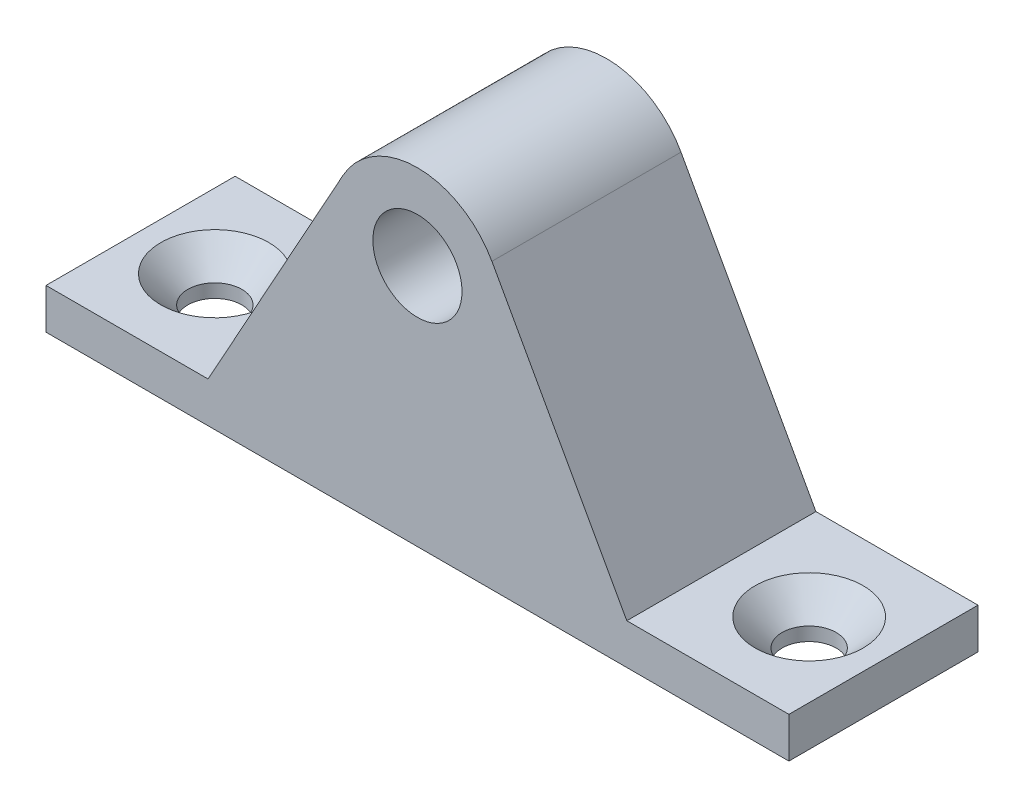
ISO-10303-21;
HEADER;
FILE_DESCRIPTION(('STEP AP214'),'2;1');
FILE_NAME('part.step','',(''),(''),'','','');
FILE_SCHEMA(('AUTOMOTIVE_DESIGN { 1 0 10303 214 1 1 1 1 }'));
ENDSEC;
DATA;
#1=APPLICATION_CONTEXT('core data for automotive mechanical design processes');
#2=APPLICATION_PROTOCOL_DEFINITION('international standard','automotive_design',2000,#1);
#3=PRODUCT_CONTEXT('',#1,'mechanical');
#4=PRODUCT('Part','Part','',(#3));
#5=PRODUCT_RELATED_PRODUCT_CATEGORY('part','',(#4));
#6=PRODUCT_DEFINITION_FORMATION('','',#4);
#7=PRODUCT_DEFINITION_CONTEXT('part definition',#1,'design');
#8=PRODUCT_DEFINITION('design','',#6,#7);
#9=PRODUCT_DEFINITION_SHAPE('','',#8);
#10=(LENGTH_UNIT() NAMED_UNIT(*) SI_UNIT(.MILLI.,.METRE.));
#11=(NAMED_UNIT(*) PLANE_ANGLE_UNIT() SI_UNIT($,.RADIAN.));
#12=(NAMED_UNIT(*) SI_UNIT($,.STERADIAN.) SOLID_ANGLE_UNIT());
#13=UNCERTAINTY_MEASURE_WITH_UNIT(LENGTH_MEASURE(1.E-05),#10,'distance_accuracy_value','');
#14=(GEOMETRIC_REPRESENTATION_CONTEXT(3) GLOBAL_UNCERTAINTY_ASSIGNED_CONTEXT((#13)) GLOBAL_UNIT_ASSIGNED_CONTEXT((#10,
#11,#12)) REPRESENTATION_CONTEXT('',''));
#15=CARTESIAN_POINT('',(0.,0.,0.));
#16=DIRECTION('',(0.,0.,1.));
#17=DIRECTION('',(1.,0.,0.));
#18=AXIS2_PLACEMENT_3D('',#15,#16,#17);
#19=CARTESIAN_POINT('',(0.,18.,-7.));
#20=DIRECTION('',(0.,0.,1.));
#21=DIRECTION('',(1.,0.,0.));
#22=AXIS2_PLACEMENT_3D('',#19,#20,#21);
#23=PLANE('',#22);
#24=DIRECTION('',(0.48415075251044,0.874984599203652,0.));
#25=VECTOR('',#24,1.);
#26=CARTESIAN_POINT('',(-11.7229872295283,9.82603091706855,-7.));
#27=LINE('',#26,#25);
#28=CARTESIAN_POINT('',(-17.1599746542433,0.,-7.));
#29=VERTEX_POINT('',#28);
#30=CARTESIAN_POINT('',(-15.5,3.,-7.));
#31=VERTEX_POINT('',#30);
#32=EDGE_CURVE('E58',#29,#31,#27,.T.);
#33=ORIENTED_EDGE('',*,*,#32,.F.);
#34=DIRECTION('',(1.,0.,0.));
#35=VECTOR('',#34,1.);
#36=CARTESIAN_POINT('',(-27.5,0.,-7.));
#37=LINE('',#36,#35);
#38=CARTESIAN_POINT('',(-27.5,0.,-7.));
#39=VERTEX_POINT('',#38);
#40=EDGE_CURVE('E187',#39,#29,#37,.T.);
#41=ORIENTED_EDGE('',*,*,#40,.F.);
#42=DIRECTION('',(0.,-1.,0.));
#43=VECTOR('',#42,1.);
#44=CARTESIAN_POINT('',(-27.5,3.,-7.));
#45=LINE('',#44,#43);
#46=CARTESIAN_POINT('',(-27.5,3.,-7.));
#47=VERTEX_POINT('',#46);
#48=EDGE_CURVE('E162',#47,#39,#45,.T.);
#49=ORIENTED_EDGE('',*,*,#48,.F.);
#50=DIRECTION('',(-1.,0.,0.));
#51=VECTOR('',#50,1.);
#52=CARTESIAN_POINT('',(-15.5,3.,-7.));
#53=LINE('',#52,#51);
#54=EDGE_CURVE('E169',#31,#47,#53,.T.);
#55=ORIENTED_EDGE('',*,*,#54,.F.);
#56=EDGE_LOOP('',(#33,#41,#49,#55));
#57=FACE_BOUND('',#56,.T.);
#58=ADVANCED_FACE('F33',(#57),#23,.F.);
#59=CARTESIAN_POINT('',(0.,18.,-7.));
#60=DIRECTION('',(0.,0.,1.));
#61=DIRECTION('',(1.,0.,0.));
#62=AXIS2_PLACEMENT_3D('',#59,#60,#61);
#63=CIRCLE('',#62,3.3);
#64=CARTESIAN_POINT('',(3.3,18.,-7.));
#65=VERTEX_POINT('',#64);
#66=EDGE_CURVE('E157',#65,#65,#63,.T.);
#67=ORIENTED_EDGE('',*,*,#66,.T.);
#68=EDGE_LOOP('',(#67));
#69=FACE_BOUND('',#68,.T.);
#70=DIRECTION('',(1.,0.,0.));
#71=VECTOR('',#70,1.);
#72=CARTESIAN_POINT('',(-3.91889425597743,9.82603091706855,-7.));
#73=LINE('',#72,#71);
#74=CARTESIAN_POINT('',(-11.7229872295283,9.82603091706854,-7.));
#75=VERTEX_POINT('',#74);
#76=CARTESIAN_POINT('',(-3.91889425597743,9.82603091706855,-7.));
#77=VERTEX_POINT('',#76);
#78=EDGE_CURVE('E146',#75,#77,#73,.T.);
#79=ORIENTED_EDGE('',*,*,#78,.F.);
#80=DIRECTION('',(-0.48415075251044,-0.874984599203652,0.));
#81=VECTOR('',#80,1.);
#82=CARTESIAN_POINT('',(-5.51240297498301,21.0501497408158,-7.));
#83=LINE('',#82,#81);
#84=CARTESIAN_POINT('',(-5.51240297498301,21.0501497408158,-7.));
#85=VERTEX_POINT('',#84);
#86=EDGE_CURVE('E197',#85,#75,#83,.T.);
#87=ORIENTED_EDGE('',*,*,#86,.F.);
#88=CARTESIAN_POINT('',(0.,18.,-7.));
#89=DIRECTION('',(0.,0.,1.));
#90=DIRECTION('',(1.,0.,0.));
#91=AXIS2_PLACEMENT_3D('',#88,#89,#90);
#92=CIRCLE('',#91,6.3);
#93=CARTESIAN_POINT('',(5.51240297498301,21.0501497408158,-7.));
#94=VERTEX_POINT('',#93);
#95=EDGE_CURVE('E195',#94,#85,#92,.T.);
#96=ORIENTED_EDGE('',*,*,#95,.F.);
#97=DIRECTION('',(-0.48415075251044,0.874984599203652,0.));
#98=VECTOR('',#97,1.);
#99=CARTESIAN_POINT('',(15.5,3.,-7.));
#100=LINE('',#99,#98);
#101=CARTESIAN_POINT('',(15.5,3.,-7.));
#102=VERTEX_POINT('',#101);
#103=EDGE_CURVE('E193',#102,#94,#100,.T.);
#104=ORIENTED_EDGE('',*,*,#103,.F.);
#105=DIRECTION('',(-1.,0.,0.));
#106=VECTOR('',#105,1.);
#107=CARTESIAN_POINT('',(27.5,3.,-7.));
#108=LINE('',#107,#106);
#109=CARTESIAN_POINT('',(27.5,3.,-7.));
#110=VERTEX_POINT('',#109);
#111=EDGE_CURVE('E191',#110,#102,#108,.T.);
#112=ORIENTED_EDGE('',*,*,#111,.F.);
#113=DIRECTION('',(0.,1.,0.));
#114=VECTOR('',#113,1.);
#115=CARTESIAN_POINT('',(27.5,0.,-7.));
#116=LINE('',#115,#114);
#117=CARTESIAN_POINT('',(27.5,0.,-7.));
#118=VERTEX_POINT('',#117);
#119=EDGE_CURVE('E189',#118,#110,#116,.T.);
#120=ORIENTED_EDGE('',*,*,#119,.F.);
#121=CARTESIAN_POINT('',(-3.91889425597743,0.,-7.));
#122=VERTEX_POINT('',#121);
#123=EDGE_CURVE('E186',#122,#118,#37,.T.);
#124=ORIENTED_EDGE('',*,*,#123,.F.);
#125=DIRECTION('',(0.,-1.,0.));
#126=VECTOR('',#125,1.);
#127=CARTESIAN_POINT('',(-3.91889425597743,0.,-7.));
#128=LINE('',#127,#126);
#129=EDGE_CURVE('E50',#77,#122,#128,.T.);
#130=ORIENTED_EDGE('',*,*,#129,.F.);
#131=EDGE_LOOP('',(#79,#87,#96,#104,#112,#120,#124,#130));
#132=FACE_BOUND('',#131,.T.);
#133=ADVANCED_FACE('F279',(#69,#132),#23,.F.);
#134=CARTESIAN_POINT('',(0.,18.,7.));
#135=DIRECTION('',(0.,0.,1.));
#136=DIRECTION('',(1.,0.,0.));
#137=AXIS2_PLACEMENT_3D('',#134,#135,#136);
#138=PLANE('',#137);
#139=DIRECTION('',(0.,-1.,0.));
#140=VECTOR('',#139,1.);
#141=CARTESIAN_POINT('',(-27.5,3.,7.));
#142=LINE('',#141,#140);
#143=CARTESIAN_POINT('',(-27.5,3.,7.));
#144=VERTEX_POINT('',#143);
#145=CARTESIAN_POINT('',(-27.5,0.,7.));
#146=VERTEX_POINT('',#145);
#147=EDGE_CURVE('E165',#144,#146,#142,.T.);
#148=ORIENTED_EDGE('',*,*,#147,.T.);
#149=DIRECTION('',(1.,0.,0.));
#150=VECTOR('',#149,1.);
#151=CARTESIAN_POINT('',(-27.5,0.,7.));
#152=LINE('',#151,#150);
#153=CARTESIAN_POINT('',(27.5,0.,7.));
#154=VERTEX_POINT('',#153);
#155=EDGE_CURVE('E168',#146,#154,#152,.T.);
#156=ORIENTED_EDGE('',*,*,#155,.T.);
#157=DIRECTION('',(0.,1.,0.));
#158=VECTOR('',#157,1.);
#159=CARTESIAN_POINT('',(27.5,0.,7.));
#160=LINE('',#159,#158);
#161=CARTESIAN_POINT('',(27.5,3.,7.));
#162=VERTEX_POINT('',#161);
#163=EDGE_CURVE('E171',#154,#162,#160,.T.);
#164=ORIENTED_EDGE('',*,*,#163,.T.);
#165=DIRECTION('',(-1.,0.,0.));
#166=VECTOR('',#165,1.);
#167=CARTESIAN_POINT('',(27.5,3.,7.));
#168=LINE('',#167,#166);
#169=CARTESIAN_POINT('',(15.5,3.,7.));
#170=VERTEX_POINT('',#169);
#171=EDGE_CURVE('E173',#162,#170,#168,.T.);
#172=ORIENTED_EDGE('',*,*,#171,.T.);
#173=DIRECTION('',(-0.48415075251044,0.874984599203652,0.));
#174=VECTOR('',#173,1.);
#175=CARTESIAN_POINT('',(15.5,3.,7.));
#176=LINE('',#175,#174);
#177=CARTESIAN_POINT('',(5.51240297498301,21.0501497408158,7.));
#178=VERTEX_POINT('',#177);
#179=EDGE_CURVE('E175',#170,#178,#176,.T.);
#180=ORIENTED_EDGE('',*,*,#179,.T.);
#181=CARTESIAN_POINT('',(0.,18.,7.));
#182=DIRECTION('',(0.,0.,1.));
#183=DIRECTION('',(1.,0.,0.));
#184=AXIS2_PLACEMENT_3D('',#181,#182,#183);
#185=CIRCLE('',#184,6.3);
#186=CARTESIAN_POINT('',(-5.51240297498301,21.0501497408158,7.));
#187=VERTEX_POINT('',#186);
#188=EDGE_CURVE('E177',#178,#187,#185,.T.);
#189=ORIENTED_EDGE('',*,*,#188,.T.);
#190=DIRECTION('',(-0.48415075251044,-0.874984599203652,0.));
#191=VECTOR('',#190,1.);
#192=CARTESIAN_POINT('',(-5.51240297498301,21.0501497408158,7.));
#193=LINE('',#192,#191);
#194=CARTESIAN_POINT('',(-15.5,3.,7.));
#195=VERTEX_POINT('',#194);
#196=EDGE_CURVE('E179',#187,#195,#193,.T.);
#197=ORIENTED_EDGE('',*,*,#196,.T.);
#198=DIRECTION('',(-1.,0.,0.));
#199=VECTOR('',#198,1.);
#200=CARTESIAN_POINT('',(-15.5,3.,7.));
#201=LINE('',#200,#199);
#202=EDGE_CURVE('E181',#195,#144,#201,.T.);
#203=ORIENTED_EDGE('',*,*,#202,.T.);
#204=EDGE_LOOP('',(#148,#156,#164,#172,#180,#189,#197,#203));
#205=FACE_BOUND('',#204,.T.);
#206=CARTESIAN_POINT('',(0.,18.,7.));
#207=DIRECTION('',(0.,0.,1.));
#208=DIRECTION('',(1.,0.,0.));
#209=AXIS2_PLACEMENT_3D('',#206,#207,#208);
#210=CIRCLE('',#209,3.3);
#211=CARTESIAN_POINT('',(3.3,18.,7.));
#212=VERTEX_POINT('',#211);
#213=EDGE_CURVE('E159',#212,#212,#210,.T.);
#214=ORIENTED_EDGE('',*,*,#213,.F.);
#215=EDGE_LOOP('',(#214));
#216=FACE_BOUND('',#215,.T.);
#217=ADVANCED_FACE('F270',(#205,#216),#138,.T.);
#218=CARTESIAN_POINT('',(-27.5,3.,7.));
#219=DIRECTION('',(1.,0.,0.));
#220=DIRECTION('',(0.,0.,-1.));
#221=AXIS2_PLACEMENT_3D('',#218,#219,#220);
#222=PLANE('',#221);
#223=ORIENTED_EDGE('',*,*,#48,.T.);
#224=DIRECTION('',(0.,0.,-1.));
#225=VECTOR('',#224,1.);
#226=CARTESIAN_POINT('',(-27.5,0.,7.));
#227=LINE('',#226,#225);
#228=EDGE_CURVE('E220',#146,#39,#227,.T.);
#229=ORIENTED_EDGE('',*,*,#228,.F.);
#230=ORIENTED_EDGE('',*,*,#147,.F.);
#231=DIRECTION('',(0.,0.,-1.));
#232=VECTOR('',#231,1.);
#233=CARTESIAN_POINT('',(-27.5,3.,7.));
#234=LINE('',#233,#232);
#235=EDGE_CURVE('E183',#144,#47,#234,.T.);
#236=ORIENTED_EDGE('',*,*,#235,.T.);
#237=EDGE_LOOP('',(#223,#229,#230,#236));
#238=FACE_BOUND('',#237,.T.);
#239=ADVANCED_FACE('F260',(#238),#222,.F.);
#240=CARTESIAN_POINT('',(-27.5,0.,7.));
#241=DIRECTION('',(0.,1.,0.));
#242=DIRECTION('',(0.,0.,1.));
#243=AXIS2_PLACEMENT_3D('',#240,#241,#242);
#244=PLANE('',#243);
#245=CARTESIAN_POINT('',(-22.,0.,0.));
#246=DIRECTION('',(0.,1.,0.));
#247=DIRECTION('',(-1.,0.,0.));
#248=AXIS2_PLACEMENT_3D('',#245,#246,#247);
#249=CIRCLE('',#248,2.);
#250=CARTESIAN_POINT('',(-24.,0.,0.));
#251=VERTEX_POINT('',#250);
#252=EDGE_CURVE('E150',#251,#251,#249,.T.);
#253=ORIENTED_EDGE('',*,*,#252,.T.);
#254=EDGE_LOOP('',(#253));
#255=FACE_BOUND('',#254,.T.);
#256=CARTESIAN_POINT('',(22.,0.,0.));
#257=DIRECTION('',(0.,1.,0.));
#258=DIRECTION('',(-1.,0.,0.));
#259=AXIS2_PLACEMENT_3D('',#256,#257,#258);
#260=CIRCLE('',#259,2.);
#261=CARTESIAN_POINT('',(20.,0.,0.));
#262=VERTEX_POINT('',#261);
#263=EDGE_CURVE('E147',#262,#262,#260,.T.);
#264=ORIENTED_EDGE('',*,*,#263,.T.);
#265=EDGE_LOOP('',(#264));
#266=FACE_BOUND('',#265,.T.);
#267=ORIENTED_EDGE('',*,*,#40,.T.);
#268=DIRECTION('',(0.,0.,1.));
#269=VECTOR('',#268,1.);
#270=CARTESIAN_POINT('',(-17.1599746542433,0.,-15.));
#271=LINE('',#270,#269);
#272=CARTESIAN_POINT('',(-17.1599746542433,0.,-15.));
#273=VERTEX_POINT('',#272);
#274=EDGE_CURVE('E152',#273,#29,#271,.T.);
#275=ORIENTED_EDGE('',*,*,#274,.F.);
#276=DIRECTION('',(-1.,0.,0.));
#277=VECTOR('',#276,1.);
#278=CARTESIAN_POINT('',(-17.1599746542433,0.,-15.));
#279=LINE('',#278,#277);
#280=CARTESIAN_POINT('',(-3.91889425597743,0.,-15.));
#281=VERTEX_POINT('',#280);
#282=EDGE_CURVE('E134',#281,#273,#279,.T.);
#283=ORIENTED_EDGE('',*,*,#282,.F.);
#284=DIRECTION('',(0.,0.,1.));
#285=VECTOR('',#284,1.);
#286=CARTESIAN_POINT('',(-3.91889425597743,0.,-15.));
#287=LINE('',#286,#285);
#288=EDGE_CURVE('E131',#281,#122,#287,.T.);
#289=ORIENTED_EDGE('',*,*,#288,.T.);
#290=ORIENTED_EDGE('',*,*,#123,.T.);
#291=DIRECTION('',(0.,0.,-1.));
#292=VECTOR('',#291,1.);
#293=CARTESIAN_POINT('',(27.5,0.,7.));
#294=LINE('',#293,#292);
#295=EDGE_CURVE('E217',#154,#118,#294,.T.);
#296=ORIENTED_EDGE('',*,*,#295,.F.);
#297=ORIENTED_EDGE('',*,*,#155,.F.);
#298=ORIENTED_EDGE('',*,*,#228,.T.);
#299=EDGE_LOOP('',(#267,#275,#283,#289,#290,#296,#297,#298));
#300=FACE_BOUND('',#299,.T.);
#301=ADVANCED_FACE('F256',(#255,#266,#300),#244,.F.);
#302=CARTESIAN_POINT('',(27.5,0.,7.));
#303=DIRECTION('',(-1.,0.,0.));
#304=DIRECTION('',(0.,0.,1.));
#305=AXIS2_PLACEMENT_3D('',#302,#303,#304);
#306=PLANE('',#305);
#307=ORIENTED_EDGE('',*,*,#119,.T.);
#308=DIRECTION('',(0.,0.,-1.));
#309=VECTOR('',#308,1.);
#310=CARTESIAN_POINT('',(27.5,3.,7.));
#311=LINE('',#310,#309);
#312=EDGE_CURVE('E214',#162,#110,#311,.T.);
#313=ORIENTED_EDGE('',*,*,#312,.F.);
#314=ORIENTED_EDGE('',*,*,#163,.F.);
#315=ORIENTED_EDGE('',*,*,#295,.T.);
#316=EDGE_LOOP('',(#307,#313,#314,#315));
#317=FACE_BOUND('',#316,.T.);
#318=ADVANCED_FACE('F291',(#317),#306,.F.);
#319=CARTESIAN_POINT('',(27.5,3.,7.));
#320=DIRECTION('',(0.,-1.,0.));
#321=DIRECTION('',(1.,0.,0.));
#322=AXIS2_PLACEMENT_3D('',#319,#320,#321);
#323=PLANE('',#322);
#324=CARTESIAN_POINT('',(22.,3.,0.));
#325=DIRECTION('',(0.,-1.,0.));
#326=DIRECTION('',(1.,0.,0.));
#327=AXIS2_PLACEMENT_3D('',#324,#325,#326);
#328=CIRCLE('',#327,4.00000000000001);
#329=CARTESIAN_POINT('',(26.,3.,0.));
#330=VERTEX_POINT('',#329);
#331=EDGE_CURVE('E11',#330,#330,#328,.T.);
#332=ORIENTED_EDGE('',*,*,#331,.T.);
#333=EDGE_LOOP('',(#332));
#334=FACE_BOUND('',#333,.T.);
#335=ORIENTED_EDGE('',*,*,#111,.T.);
#336=DIRECTION('',(0.,0.,-1.));
#337=VECTOR('',#336,1.);
#338=CARTESIAN_POINT('',(15.5,3.,7.));
#339=LINE('',#338,#337);
#340=EDGE_CURVE('E211',#170,#102,#339,.T.);
#341=ORIENTED_EDGE('',*,*,#340,.F.);
#342=ORIENTED_EDGE('',*,*,#171,.F.);
#343=ORIENTED_EDGE('',*,*,#312,.T.);
#344=EDGE_LOOP('',(#335,#341,#342,#343));
#345=FACE_BOUND('',#344,.T.);
#346=ADVANCED_FACE('F287',(#334,#345),#323,.F.);
#347=CARTESIAN_POINT('',(15.5,3.,7.));
#348=DIRECTION('',(-0.874984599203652,-0.48415075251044,0.));
#349=DIRECTION('',(0.48415075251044,-0.874984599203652,0.));
#350=AXIS2_PLACEMENT_3D('',#347,#348,#349);
#351=PLANE('',#350);
#352=ORIENTED_EDGE('',*,*,#103,.T.);
#353=DIRECTION('',(0.,0.,-1.));
#354=VECTOR('',#353,1.);
#355=CARTESIAN_POINT('',(5.51240297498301,21.0501497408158,7.));
#356=LINE('',#355,#354);
#357=EDGE_CURVE('E208',#178,#94,#356,.T.);
#358=ORIENTED_EDGE('',*,*,#357,.F.);
#359=ORIENTED_EDGE('',*,*,#179,.F.);
#360=ORIENTED_EDGE('',*,*,#340,.T.);
#361=EDGE_LOOP('',(#352,#358,#359,#360));
#362=FACE_BOUND('',#361,.T.);
#363=ADVANCED_FACE('F283',(#362),#351,.F.);
#364=CARTESIAN_POINT('',(0.,18.,7.));
#365=DIRECTION('',(0.,0.,-1.));
#366=DIRECTION('',(-1.,0.,0.));
#367=AXIS2_PLACEMENT_3D('',#364,#365,#366);
#368=CYLINDRICAL_SURFACE('',#367,6.3);
#369=ORIENTED_EDGE('',*,*,#95,.T.);
#370=DIRECTION('',(0.,0.,-1.));
#371=VECTOR('',#370,1.);
#372=CARTESIAN_POINT('',(-5.51240297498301,21.0501497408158,7.));
#373=LINE('',#372,#371);
#374=EDGE_CURVE('E205',#187,#85,#373,.T.);
#375=ORIENTED_EDGE('',*,*,#374,.F.);
#376=ORIENTED_EDGE('',*,*,#188,.F.);
#377=ORIENTED_EDGE('',*,*,#357,.T.);
#378=EDGE_LOOP('',(#369,#375,#376,#377));
#379=FACE_BOUND('',#378,.T.);
#380=ADVANCED_FACE('F276',(#379),#368,.T.);
#381=CARTESIAN_POINT('',(-5.51240297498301,21.0501497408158,7.));
#382=DIRECTION('',(0.874984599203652,-0.48415075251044,0.));
#383=DIRECTION('',(0.48415075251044,0.874984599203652,0.));
#384=AXIS2_PLACEMENT_3D('',#381,#382,#383);
#385=PLANE('',#384);
#386=CARTESIAN_POINT('',(-13.6685596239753,6.30988254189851,-10.8463188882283));
#387=DIRECTION('',(0.874984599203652,-0.48415075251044,0.));
#388=DIRECTION('',(0.48415075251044,0.874984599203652,0.));
#389=AXIS2_PLACEMENT_3D('',#386,#387,#388);
#390=ELLIPSE('',#389,3.42863177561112,3.);
#391=CARTESIAN_POINT('',(-12.008584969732,9.30988254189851,-10.8463188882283));
#392=VERTEX_POINT('',#391);
#393=EDGE_CURVE('E37',#392,#392,#390,.T.);
#394=ORIENTED_EDGE('',*,*,#393,.T.);
#395=EDGE_LOOP('',(#394));
#396=FACE_BOUND('',#395,.T.);
#397=ORIENTED_EDGE('',*,*,#86,.T.);
#398=DIRECTION('',(0.,0.,1.));
#399=VECTOR('',#398,1.);
#400=CARTESIAN_POINT('',(-11.7229872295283,9.82603091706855,-15.));
#401=LINE('',#400,#399);
#402=CARTESIAN_POINT('',(-11.7229872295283,9.82603091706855,-15.));
#403=VERTEX_POINT('',#402);
#404=EDGE_CURVE('E246',#403,#75,#401,.T.);
#405=ORIENTED_EDGE('',*,*,#404,.F.);
#406=DIRECTION('',(0.48415075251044,0.874984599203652,0.));
#407=VECTOR('',#406,1.);
#408=CARTESIAN_POINT('',(-11.7229872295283,9.82603091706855,-15.));
#409=LINE('',#408,#407);
#410=EDGE_CURVE('E140',#273,#403,#409,.T.);
#411=ORIENTED_EDGE('',*,*,#410,.F.);
#412=ORIENTED_EDGE('',*,*,#274,.T.);
#413=ORIENTED_EDGE('',*,*,#32,.T.);
#414=DIRECTION('',(0.,0.,-1.));
#415=VECTOR('',#414,1.);
#416=CARTESIAN_POINT('',(-15.5,3.,7.));
#417=LINE('',#416,#415);
#418=EDGE_CURVE('E203',#195,#31,#417,.T.);
#419=ORIENTED_EDGE('',*,*,#418,.F.);
#420=ORIENTED_EDGE('',*,*,#196,.F.);
#421=ORIENTED_EDGE('',*,*,#374,.T.);
#422=EDGE_LOOP('',(#397,#405,#411,#412,#413,#419,#420,#421));
#423=FACE_BOUND('',#422,.T.);
#424=ADVANCED_FACE('F253',(#396,#423),#385,.F.);
#425=CARTESIAN_POINT('',(-15.5,3.,7.));
#426=DIRECTION('',(0.,-1.,0.));
#427=DIRECTION('',(1.,0.,0.));
#428=AXIS2_PLACEMENT_3D('',#425,#426,#427);
#429=PLANE('',#428);
#430=CARTESIAN_POINT('',(-22.,3.,0.));
#431=DIRECTION('',(0.,-1.,0.));
#432=DIRECTION('',(1.,0.,0.));
#433=AXIS2_PLACEMENT_3D('',#430,#431,#432);
#434=CIRCLE('',#433,4.);
#435=CARTESIAN_POINT('',(-18.,3.,0.));
#436=VERTEX_POINT('',#435);
#437=EDGE_CURVE('E226',#436,#436,#434,.T.);
#438=ORIENTED_EDGE('',*,*,#437,.T.);
#439=EDGE_LOOP('',(#438));
#440=FACE_BOUND('',#439,.T.);
#441=ORIENTED_EDGE('',*,*,#54,.T.);
#442=ORIENTED_EDGE('',*,*,#235,.F.);
#443=ORIENTED_EDGE('',*,*,#202,.F.);
#444=ORIENTED_EDGE('',*,*,#418,.T.);
#445=EDGE_LOOP('',(#441,#442,#443,#444));
#446=FACE_BOUND('',#445,.T.);
#447=ADVANCED_FACE('F265',(#440,#446),#429,.F.);
#448=CARTESIAN_POINT('',(0.,18.,7.));
#449=DIRECTION('',(0.,0.,-1.));
#450=DIRECTION('',(-1.,0.,0.));
#451=AXIS2_PLACEMENT_3D('',#448,#449,#450);
#452=CYLINDRICAL_SURFACE('',#451,3.3);
#453=ORIENTED_EDGE('',*,*,#213,.T.);
#454=EDGE_LOOP('',(#453));
#455=FACE_BOUND('',#454,.T.);
#456=ORIENTED_EDGE('',*,*,#66,.F.);
#457=EDGE_LOOP('',(#456));
#458=FACE_BOUND('',#457,.T.);
#459=ADVANCED_FACE('F316',(#455,#458),#452,.F.);
#460=CARTESIAN_POINT('',(-22.,0.,0.));
#461=DIRECTION('',(0.,1.,0.));
#462=DIRECTION('',(-1.,0.,0.));
#463=AXIS2_PLACEMENT_3D('',#460,#461,#462);
#464=CYLINDRICAL_SURFACE('',#463,2.);
#465=CARTESIAN_POINT('',(-22.,1.00000000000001,0.));
#466=DIRECTION('',(0.,-1.,0.));
#467=DIRECTION('',(0.,0.,-1.));
#468=AXIS2_PLACEMENT_3D('',#465,#466,#467);
#469=CIRCLE('',#468,2.);
#470=CARTESIAN_POINT('',(-22.,1.00000000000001,-2.));
#471=VERTEX_POINT('',#470);
#472=EDGE_CURVE('E223',#471,#471,#469,.F.);
#473=ORIENTED_EDGE('',*,*,#472,.T.);
#474=EDGE_LOOP('',(#473));
#475=FACE_BOUND('',#474,.T.);
#476=ORIENTED_EDGE('',*,*,#252,.F.);
#477=EDGE_LOOP('',(#476));
#478=FACE_BOUND('',#477,.T.);
#479=ADVANCED_FACE('F348',(#475,#478),#464,.F.);
#480=CARTESIAN_POINT('',(22.,0.,0.));
#481=DIRECTION('',(0.,1.,0.));
#482=DIRECTION('',(-1.,0.,0.));
#483=AXIS2_PLACEMENT_3D('',#480,#481,#482);
#484=CYLINDRICAL_SURFACE('',#483,2.);
#485=CARTESIAN_POINT('',(22.,0.999999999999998,0.));
#486=DIRECTION('',(0.,-1.,0.));
#487=DIRECTION('',(0.,0.,-1.));
#488=AXIS2_PLACEMENT_3D('',#485,#486,#487);
#489=CIRCLE('',#488,2.);
#490=CARTESIAN_POINT('',(22.,0.999999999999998,-2.00000000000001));
#491=VERTEX_POINT('',#490);
#492=EDGE_CURVE('E42',#491,#491,#489,.F.);
#493=ORIENTED_EDGE('',*,*,#492,.T.);
#494=EDGE_LOOP('',(#493));
#495=FACE_BOUND('',#494,.T.);
#496=ORIENTED_EDGE('',*,*,#263,.F.);
#497=EDGE_LOOP('',(#496));
#498=FACE_BOUND('',#497,.T.);
#499=ADVANCED_FACE('F354',(#495,#498),#484,.F.);
#500=CARTESIAN_POINT('',(-22.,1.00000000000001,0.));
#501=DIRECTION('',(0.,1.,0.));
#502=DIRECTION('',(0.,0.,1.));
#503=AXIS2_PLACEMENT_3D('',#500,#501,#502);
#504=CONICAL_SURFACE('',#503,2.,0.785398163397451);
#505=ORIENTED_EDGE('',*,*,#437,.F.);
#506=EDGE_LOOP('',(#505));
#507=FACE_BOUND('',#506,.T.);
#508=ORIENTED_EDGE('',*,*,#472,.F.);
#509=EDGE_LOOP('',(#508));
#510=FACE_BOUND('',#509,.T.);
#511=ADVANCED_FACE('F362',(#507,#510),#504,.F.);
#512=CARTESIAN_POINT('',(22.,0.999999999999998,0.));
#513=DIRECTION('',(0.,1.,0.));
#514=DIRECTION('',(0.,0.,1.));
#515=AXIS2_PLACEMENT_3D('',#512,#513,#514);
#516=CONICAL_SURFACE('',#515,2.,0.785398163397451);
#517=ORIENTED_EDGE('',*,*,#331,.F.);
#518=EDGE_LOOP('',(#517));
#519=FACE_BOUND('',#518,.T.);
#520=ORIENTED_EDGE('',*,*,#492,.F.);
#521=EDGE_LOOP('',(#520));
#522=FACE_BOUND('',#521,.T.);
#523=ADVANCED_FACE('F35',(#519,#522),#516,.F.);
#524=CARTESIAN_POINT('',(-3.91889425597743,9.82603091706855,-15.));
#525=DIRECTION('',(0.,-1.,0.));
#526=DIRECTION('',(0.,0.,-1.));
#527=AXIS2_PLACEMENT_3D('',#524,#525,#526);
#528=PLANE('',#527);
#529=ORIENTED_EDGE('',*,*,#78,.T.);
#530=DIRECTION('',(0.,0.,1.));
#531=VECTOR('',#530,1.);
#532=CARTESIAN_POINT('',(-3.91889425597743,9.82603091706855,-15.));
#533=LINE('',#532,#531);
#534=CARTESIAN_POINT('',(-3.91889425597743,9.82603091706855,-15.));
#535=VERTEX_POINT('',#534);
#536=EDGE_CURVE('E128',#535,#77,#533,.T.);
#537=ORIENTED_EDGE('',*,*,#536,.F.);
#538=DIRECTION('',(1.,0.,0.));
#539=VECTOR('',#538,1.);
#540=CARTESIAN_POINT('',(-3.91889425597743,9.82603091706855,-15.));
#541=LINE('',#540,#539);
#542=EDGE_CURVE('E135',#403,#535,#541,.T.);
#543=ORIENTED_EDGE('',*,*,#542,.F.);
#544=ORIENTED_EDGE('',*,*,#404,.T.);
#545=EDGE_LOOP('',(#529,#537,#543,#544));
#546=FACE_BOUND('',#545,.T.);
#547=ADVANCED_FACE('F145',(#546),#528,.F.);
#548=CARTESIAN_POINT('',(-3.91889425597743,0.,-15.));
#549=DIRECTION('',(-1.,0.,0.));
#550=DIRECTION('',(0.,0.,1.));
#551=AXIS2_PLACEMENT_3D('',#548,#549,#550);
#552=PLANE('',#551);
#553=CARTESIAN_POINT('',(-3.91889425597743,6.30988254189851,-10.8463188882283));
#554=DIRECTION('',(1.,0.,0.));
#555=DIRECTION('',(0.,0.,-1.));
#556=AXIS2_PLACEMENT_3D('',#553,#554,#555);
#557=CIRCLE('',#556,1.25);
#558=CARTESIAN_POINT('',(-3.91889425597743,6.30988254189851,-12.0963188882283));
#559=VERTEX_POINT('',#558);
#560=EDGE_CURVE('E236',#559,#559,#557,.T.);
#561=ORIENTED_EDGE('',*,*,#560,.F.);
#562=EDGE_LOOP('',(#561));
#563=FACE_BOUND('',#562,.T.);
#564=ORIENTED_EDGE('',*,*,#129,.T.);
#565=ORIENTED_EDGE('',*,*,#288,.F.);
#566=DIRECTION('',(0.,-1.,0.));
#567=VECTOR('',#566,1.);
#568=CARTESIAN_POINT('',(-3.91889425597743,0.,-15.));
#569=LINE('',#568,#567);
#570=EDGE_CURVE('E124',#535,#281,#569,.T.);
#571=ORIENTED_EDGE('',*,*,#570,.F.);
#572=ORIENTED_EDGE('',*,*,#536,.T.);
#573=EDGE_LOOP('',(#564,#565,#571,#572));
#574=FACE_BOUND('',#573,.T.);
#575=ADVANCED_FACE('F126',(#563,#574),#552,.F.);
#576=CARTESIAN_POINT('',(0.,0.,-15.));
#577=DIRECTION('',(0.,0.,-1.));
#578=DIRECTION('',(-1.,0.,0.));
#579=AXIS2_PLACEMENT_3D('',#576,#577,#578);
#580=PLANE('',#579);
#581=ORIENTED_EDGE('',*,*,#542,.T.);
#582=ORIENTED_EDGE('',*,*,#570,.T.);
#583=ORIENTED_EDGE('',*,*,#282,.T.);
#584=ORIENTED_EDGE('',*,*,#410,.T.);
#585=EDGE_LOOP('',(#581,#582,#583,#584));
#586=FACE_BOUND('',#585,.T.);
#587=ADVANCED_FACE('F138',(#586),#580,.T.);
#588=CARTESIAN_POINT('',(-27.5,6.30988254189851,-10.8463188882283));
#589=DIRECTION('',(1.,0.,0.));
#590=DIRECTION('',(0.,0.,-1.));
#591=AXIS2_PLACEMENT_3D('',#588,#589,#590);
#592=CYLINDRICAL_SURFACE('',#591,1.25);
#593=CARTESIAN_POINT('',(-7.91889425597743,6.30988254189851,-10.8463188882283));
#594=DIRECTION('',(1.,0.,0.));
#595=DIRECTION('',(0.,0.,-1.));
#596=AXIS2_PLACEMENT_3D('',#593,#594,#595);
#597=CIRCLE('',#596,1.25);
#598=CARTESIAN_POINT('',(-7.91889425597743,6.30988254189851,-12.0963188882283));
#599=VERTEX_POINT('',#598);
#600=EDGE_CURVE('E230',#599,#599,#597,.F.);
#601=ORIENTED_EDGE('',*,*,#600,.T.);
#602=EDGE_LOOP('',(#601));
#603=FACE_BOUND('',#602,.T.);
#604=ORIENTED_EDGE('',*,*,#560,.T.);
#605=EDGE_LOOP('',(#604));
#606=FACE_BOUND('',#605,.T.);
#607=ADVANCED_FACE('F410',(#603,#606),#592,.F.);
#608=CARTESIAN_POINT('',(-27.5,6.30988254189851,-10.8463188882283));
#609=DIRECTION('',(1.,0.,0.));
#610=DIRECTION('',(0.,0.,-1.));
#611=AXIS2_PLACEMENT_3D('',#608,#609,#610);
#612=CYLINDRICAL_SURFACE('',#611,3.);
#613=CARTESIAN_POINT('',(-7.91889425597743,6.30988254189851,-10.8463188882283));
#614=DIRECTION('',(1.,0.,0.));
#615=DIRECTION('',(0.,0.,-1.));
#616=AXIS2_PLACEMENT_3D('',#613,#614,#615);
#617=CIRCLE('',#616,3.);
#618=CARTESIAN_POINT('',(-7.91889425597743,6.30988254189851,-13.8463188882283));
#619=VERTEX_POINT('',#618);
#620=EDGE_CURVE('E232',#619,#619,#617,.T.);
#621=ORIENTED_EDGE('',*,*,#620,.T.);
#622=EDGE_LOOP('',(#621));
#623=FACE_BOUND('',#622,.T.);
#624=ORIENTED_EDGE('',*,*,#393,.F.);
#625=EDGE_LOOP('',(#624));
#626=FACE_BOUND('',#625,.T.);
#627=ADVANCED_FACE('F416',(#623,#626),#612,.F.);
#628=CARTESIAN_POINT('',(-7.91889425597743,6.30988254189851,-10.8463188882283));
#629=DIRECTION('',(1.,0.,0.));
#630=DIRECTION('',(0.,0.,-1.));
#631=AXIS2_PLACEMENT_3D('',#628,#629,#630);
#632=PLANE('',#631);
#633=ORIENTED_EDGE('',*,*,#620,.F.);
#634=EDGE_LOOP('',(#633));
#635=FACE_BOUND('',#634,.T.);
#636=ORIENTED_EDGE('',*,*,#600,.F.);
#637=EDGE_LOOP('',(#636));
#638=FACE_BOUND('',#637,.T.);
#639=ADVANCED_FACE('F423',(#635,#638),#632,.F.);
#640=CLOSED_SHELL('',(#58,#133,#217,#239,#301,#318,#346,#363,#380,#424,#447,#459,#479,#499,#511,
#523,#547,#575,#587,#607,#627,#639));
#641=MANIFOLD_SOLID_BREP('B2',#640);
#642=ADVANCED_BREP_SHAPE_REPRESENTATION('',(#18,#641),#14);
#643=SHAPE_DEFINITION_REPRESENTATION(#9,#642);
ENDSEC;
END-ISO-10303-21;
